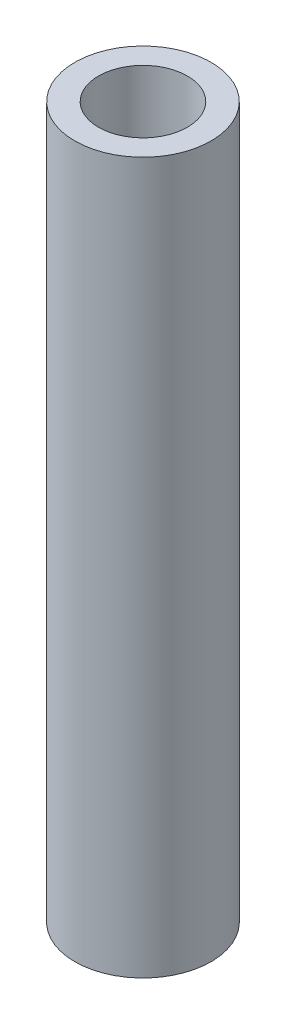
ISO-10303-21;
HEADER;
FILE_DESCRIPTION(('STEP AP214'),'2;1');
FILE_NAME('part.step','',(''),(''),'','','');
FILE_SCHEMA(('AUTOMOTIVE_DESIGN { 1 0 10303 214 1 1 1 1 }'));
ENDSEC;
DATA;
#1=APPLICATION_CONTEXT('core data for automotive mechanical design processes');
#2=APPLICATION_PROTOCOL_DEFINITION('international standard','automotive_design',2000,#1);
#3=PRODUCT_CONTEXT('',#1,'mechanical');
#4=PRODUCT('Part','Part','',(#3));
#5=PRODUCT_RELATED_PRODUCT_CATEGORY('part','',(#4));
#6=PRODUCT_DEFINITION_FORMATION('','',#4);
#7=PRODUCT_DEFINITION_CONTEXT('part definition',#1,'design');
#8=PRODUCT_DEFINITION('design','',#6,#7);
#9=PRODUCT_DEFINITION_SHAPE('','',#8);
#10=(LENGTH_UNIT() NAMED_UNIT(*) SI_UNIT(.MILLI.,.METRE.));
#11=(NAMED_UNIT(*) PLANE_ANGLE_UNIT() SI_UNIT($,.RADIAN.));
#12=(NAMED_UNIT(*) SI_UNIT($,.STERADIAN.) SOLID_ANGLE_UNIT());
#13=UNCERTAINTY_MEASURE_WITH_UNIT(LENGTH_MEASURE(1.E-05),#10,'distance_accuracy_value','');
#14=(GEOMETRIC_REPRESENTATION_CONTEXT(3) GLOBAL_UNCERTAINTY_ASSIGNED_CONTEXT((#13)) GLOBAL_UNIT_ASSIGNED_CONTEXT((#10,
#11,#12)) REPRESENTATION_CONTEXT('',''));
#15=CARTESIAN_POINT('',(0.,0.,0.));
#16=DIRECTION('',(0.,0.,1.));
#17=DIRECTION('',(1.,0.,0.));
#18=AXIS2_PLACEMENT_3D('',#15,#16,#17);
#19=CARTESIAN_POINT('',(0.,30.,0.));
#20=DIRECTION('',(0.,1.,0.));
#21=DIRECTION('',(0.,0.,1.));
#22=AXIS2_PLACEMENT_3D('',#19,#20,#21);
#23=PLANE('',#22);
#24=CARTESIAN_POINT('',(0.,30.,0.));
#25=DIRECTION('',(0.,1.,0.));
#26=DIRECTION('',(0.,0.,1.));
#27=AXIS2_PLACEMENT_3D('',#24,#25,#26);
#28=CIRCLE('',#27,2.87499996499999);
#29=CARTESIAN_POINT('',(0.,30.,2.87499996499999));
#30=VERTEX_POINT('',#29);
#31=EDGE_CURVE('E10',#30,#30,#28,.T.);
#32=ORIENTED_EDGE('',*,*,#31,.T.);
#33=EDGE_LOOP('',(#32));
#34=FACE_BOUND('',#33,.T.);
#35=CARTESIAN_POINT('',(0.,30.,0.));
#36=DIRECTION('',(0.,1.,0.));
#37=DIRECTION('',(0.,0.,1.));
#38=AXIS2_PLACEMENT_3D('',#35,#36,#37);
#39=CIRCLE('',#38,1.87500006);
#40=CARTESIAN_POINT('',(0.,30.,1.87500006));
#41=VERTEX_POINT('',#40);
#42=EDGE_CURVE('E42',#41,#41,#39,.T.);
#43=ORIENTED_EDGE('',*,*,#42,.F.);
#44=EDGE_LOOP('',(#43));
#45=FACE_BOUND('',#44,.T.);
#46=ADVANCED_FACE('F31',(#34,#45),#23,.T.);
#47=CARTESIAN_POINT('',(0.,0.,0.));
#48=DIRECTION('',(0.,1.,0.));
#49=DIRECTION('',(0.,0.,1.));
#50=AXIS2_PLACEMENT_3D('',#47,#48,#49);
#51=PLANE('',#50);
#52=CARTESIAN_POINT('',(0.,0.,0.));
#53=DIRECTION('',(0.,1.,0.));
#54=DIRECTION('',(0.,0.,1.));
#55=AXIS2_PLACEMENT_3D('',#52,#53,#54);
#56=CIRCLE('',#55,2.87499996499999);
#57=CARTESIAN_POINT('',(0.,0.,2.87499996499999));
#58=VERTEX_POINT('',#57);
#59=EDGE_CURVE('E35',#58,#58,#56,.T.);
#60=ORIENTED_EDGE('',*,*,#59,.F.);
#61=EDGE_LOOP('',(#60));
#62=FACE_BOUND('',#61,.T.);
#63=CARTESIAN_POINT('',(0.,0.,0.));
#64=DIRECTION('',(0.,1.,0.));
#65=DIRECTION('',(0.,0.,1.));
#66=AXIS2_PLACEMENT_3D('',#63,#64,#65);
#67=CIRCLE('',#66,1.87500006);
#68=CARTESIAN_POINT('',(0.,0.,1.87500006));
#69=VERTEX_POINT('',#68);
#70=EDGE_CURVE('E44',#69,#69,#67,.T.);
#71=ORIENTED_EDGE('',*,*,#70,.T.);
#72=EDGE_LOOP('',(#71));
#73=FACE_BOUND('',#72,.T.);
#74=ADVANCED_FACE('F54',(#62,#73),#51,.F.);
#75=CARTESIAN_POINT('',(0.,30.,0.));
#76=DIRECTION('',(0.,-1.,0.));
#77=DIRECTION('',(0.,0.,-1.));
#78=AXIS2_PLACEMENT_3D('',#75,#76,#77);
#79=CYLINDRICAL_SURFACE('',#78,2.87499996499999);
#80=ORIENTED_EDGE('',*,*,#31,.F.);
#81=EDGE_LOOP('',(#80));
#82=FACE_BOUND('',#81,.T.);
#83=ORIENTED_EDGE('',*,*,#59,.T.);
#84=EDGE_LOOP('',(#83));
#85=FACE_BOUND('',#84,.T.);
#86=ADVANCED_FACE('F33',(#82,#85),#79,.T.);
#87=CARTESIAN_POINT('',(0.,30.,0.));
#88=DIRECTION('',(0.,-1.,0.));
#89=DIRECTION('',(0.,0.,-1.));
#90=AXIS2_PLACEMENT_3D('',#87,#88,#89);
#91=CYLINDRICAL_SURFACE('',#90,1.87500006);
#92=ORIENTED_EDGE('',*,*,#42,.T.);
#93=EDGE_LOOP('',(#92));
#94=FACE_BOUND('',#93,.T.);
#95=ORIENTED_EDGE('',*,*,#70,.F.);
#96=EDGE_LOOP('',(#95));
#97=FACE_BOUND('',#96,.T.);
#98=ADVANCED_FACE('F50',(#94,#97),#91,.F.);
#99=CLOSED_SHELL('',(#46,#74,#86,#98));
#100=MANIFOLD_SOLID_BREP('B2',#99);
#101=ADVANCED_BREP_SHAPE_REPRESENTATION('',(#18,#100),#14);
#102=SHAPE_DEFINITION_REPRESENTATION(#9,#101);
ENDSEC;
END-ISO-10303-21;
